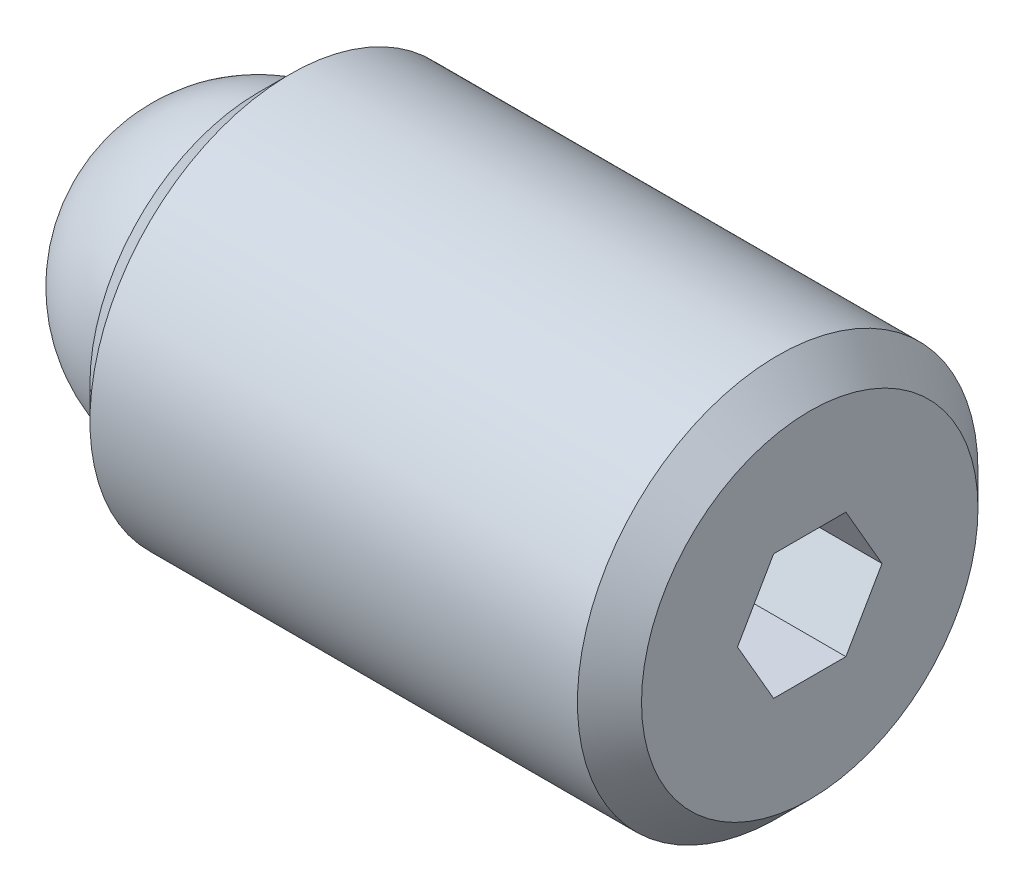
from build123d import *

# Parameters (mm, degrees)
SKETCH2_R           = 3.175
BOSS_EXTRUDE1_DEPTH = 8.74395
CHAMFER1_SIZE       = 0.508
CHAMFER2_SIZE       = 0.508
CUT_EXTRUDE2_DEPTH  = 2.286
SKETCH3_R           = 2.38125
CUT_EXTRUDE3_DEPTH  = 1.984375


with BuildPart() as part:
    # Sketch2 → Boss-Extrude1 (new body)
    with BuildSketch(Plane(origin=(0, 0, 0), x_dir=(0, 0, -1), z_dir=(1, 0, 0))):
        Circle(SKETCH2_R)
    extrude(amount=BOSS_EXTRUDE1_DEPTH)

    # Chamfer1
    chamfer1_edges = [part.edges().sort_by_distance(p)[0] for p in [
        (0, 0, 3.175),
    ]]
    chamfer(chamfer1_edges, length=CHAMFER1_SIZE)

    # Chamfer2
    chamfer2_edges = [part.edges().sort_by_distance(p)[0] for p in [
        (8.74395, 0, 3.175),
    ]]
    chamfer(chamfer2_edges, length=CHAMFER2_SIZE)

    # Sketch4 → Cut-Extrude2 (cut)
    with BuildSketch(Plane(origin=(8.74395, 0, 0), x_dir=(0, 0, -1), z_dir=(1, 0, 0))):
        Polygon((1.14567944, 0), (0.57283972, 0.9921875), (-0.57283972, 0.9921875), (-1.14567944, 0), (-0.57283972, -0.9921875), (0.57283972, -0.9921875), align=None)
    extrude(amount=-CUT_EXTRUDE2_DEPTH, mode=Mode.SUBTRACT)

    # Sketch3 → Cut-Extrude3 (cut)
    with BuildSketch(Plane.ZY):
        Circle(SKETCH3_R)
    extrude(amount=-CUT_EXTRUDE3_DEPTH, mode=Mode.SUBTRACT)


with BuildPart() as body_2:
    # Sketch5 → Revolve1 (revolve)
    with BuildSketch(Plane.ZY):
        with BuildLine():
            Line((0, 0), (0, -2.38125))
            ThreePointArc((0, -2.38125), (-2.38125, 0), (0, 2.38125))
            Line((0, 2.38125), (0, 0))
        make_face()
    revolve(axis=Axis((0, 0, 0), (0, 1, 0)))


solid = Compound([part.part, body_2.part])
